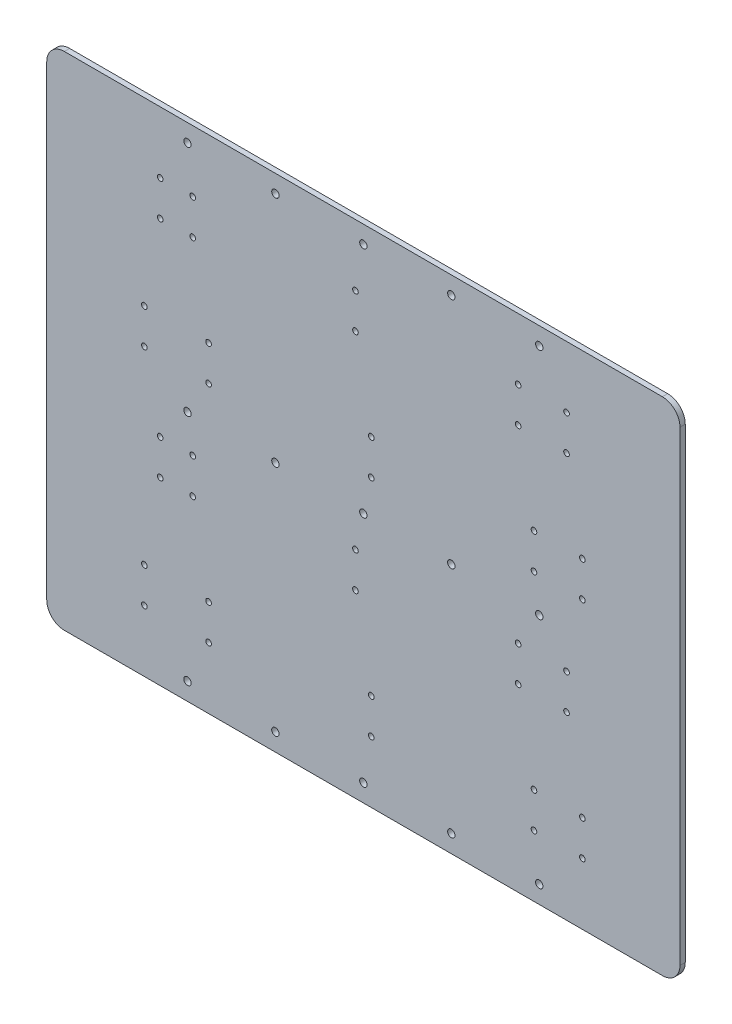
from build123d import *

# Parameters (mm, degrees)
SKETCH_1_W          = 360
SKETCH_1_H          = 275
EXTRUDE_1_DEPTH     = 3
SKETCH_3_R          = 1.6
CUT_EXTRUDE_1_DEPTH = 3
SKETCH_5_W          = 360
SKETCH_5_H          = 3
EXTRUDE_2_DEPTH     = 5
SKETCH_6_W          = 360
SKETCH_6_H          = 3
EXTRUDE_3_DEPTH     = 5
SKETCH_7_R          = 2.1
CUT_EXTRUDE_2_DEPTH = 10
FILLET_1_R          = 10


with BuildPart() as part:
    # Sketch 1 → Extrude 1 (new body)
    with BuildSketch(Plane.XY):
        with Locations((180, 137.5)):
            Rectangle(SKETCH_1_W, SKETCH_1_H)
    extrude(amount=EXTRUDE_1_DEPTH)

    # Sketch 3 → Cut-Extrude 1 (cut)
    with BuildSketch(Plane.XY.offset(3)):
        with Locations((175.5, 245)):
            Circle(SKETCH_3_R)
        with Locations((175.5, 225)):
            Circle(SKETCH_3_R)
        with Locations((184.5, 177.5)):
            Circle(SKETCH_3_R)
        with Locations((184.5, 157.5)):
            Circle(SKETCH_3_R)
        with Locations((184.5, 30)):
            Circle(SKETCH_3_R)
        with Locations((184.5, 50)):
            Circle(SKETCH_3_R)
        with Locations((175.5, 97.5)):
            Circle(SKETCH_3_R)
        with Locations((175.5, 117.5)):
            Circle(SKETCH_3_R)
        with Locations((295.5, 245)):
            Circle(SKETCH_3_R)
        with Locations((295.5, 225)):
            Circle(SKETCH_3_R)
        with Locations((304.5, 177.5)):
            Circle(SKETCH_3_R)
        with Locations((304.5, 157.5)):
            Circle(SKETCH_3_R)
        with Locations((304.5, 30)):
            Circle(SKETCH_3_R)
        with Locations((304.5, 50)):
            Circle(SKETCH_3_R)
        with Locations((295.5, 97.5)):
            Circle(SKETCH_3_R)
        with Locations((295.5, 117.5)):
            Circle(SKETCH_3_R)
        with Locations(Location((64.5, 117.5, 0), (0, 0, 180))):
            Circle(SKETCH_3_R)
        with Locations(Location((64.5, 97.5, 0), (0, 0, 180))):
            Circle(SKETCH_3_R)
        with Locations(Location((55.5, 50, 0), (0, 0, 180))):
            Circle(SKETCH_3_R)
        with Locations(Location((55.5, 30, 0), (0, 0, 180))):
            Circle(SKETCH_3_R)
        with Locations(Location((55.5, 157.5, 0), (0, 0, 180))):
            Circle(SKETCH_3_R)
        with Locations(Location((55.5, 177.5, 0), (0, 0, 180))):
            Circle(SKETCH_3_R)
        with Locations(Location((64.5, 225, 0), (0, 0, 180))):
            Circle(SKETCH_3_R)
        with Locations(Location((64.5, 245, 0), (0, 0, 180))):
            Circle(SKETCH_3_R)
        with Locations((268, 245)):
            Circle(SKETCH_3_R)
        with Locations((268, 225)):
            Circle(SKETCH_3_R)
        with Locations((277, 177.5)):
            Circle(SKETCH_3_R)
        with Locations((277, 157.5)):
            Circle(SKETCH_3_R)
        with Locations((277, 30)):
            Circle(SKETCH_3_R)
        with Locations((277, 50)):
            Circle(SKETCH_3_R)
        with Locations((268, 97.5)):
            Circle(SKETCH_3_R)
        with Locations((268, 117.5)):
            Circle(SKETCH_3_R)
        with Locations((83, 245)):
            Circle(SKETCH_3_R)
        with Locations((83, 225)):
            Circle(SKETCH_3_R)
        with Locations((92, 177.5)):
            Circle(SKETCH_3_R)
        with Locations((92, 157.5)):
            Circle(SKETCH_3_R)
        with Locations((92, 30)):
            Circle(SKETCH_3_R)
        with Locations((92, 50)):
            Circle(SKETCH_3_R)
        with Locations((83, 97.5)):
            Circle(SKETCH_3_R)
        with Locations((83, 117.5)):
            Circle(SKETCH_3_R)
    extrude(amount=-CUT_EXTRUDE_1_DEPTH, mode=Mode.SUBTRACT)

    # Sketch 5 → Extrude 2 (add)
    with BuildSketch(Plane(origin=(0, 275, 0), x_dir=(1, 0, 0), z_dir=(0, 1, 0))):
        with Locations((180, -1.5)):
            Rectangle(SKETCH_5_W, SKETCH_5_H)
    extrude(amount=EXTRUDE_2_DEPTH)

    # Sketch 6 → Extrude 3 (add)
    with BuildSketch(Plane.XZ):
        with Locations((180, 1.5)):
            Rectangle(SKETCH_6_W, SKETCH_6_H)
    extrude(amount=EXTRUDE_3_DEPTH)

    # Sketch 7 → Cut-Extrude 2 (cut)
    with BuildSketch(Plane.XY.offset(3)):
        with Locations((180, 5)):
            Circle(SKETCH_7_R)
        with Locations((130, 5)):
            Circle(SKETCH_7_R)
        with Locations((80, 5)):
            Circle(SKETCH_7_R)
        with Locations(Location((280, 5, 0), (0, 0, 180))):
            Circle(SKETCH_7_R)
        with Locations(Location((230, 5, 0), (0, 0, 180))):
            Circle(SKETCH_7_R)
        with Locations((230, 270)):
            Circle(SKETCH_7_R)
        with Locations((280, 270)):
            Circle(SKETCH_7_R)
        with Locations(Location((80, 270, 0), (0, 0, 180))):
            Circle(SKETCH_7_R)
        with Locations(Location((130, 270, 0), (0, 0, 180))):
            Circle(SKETCH_7_R)
        with Locations(Location((180, 270, 0), (0, 0, 180))):
            Circle(SKETCH_7_R)
        with Locations(Location((280, 137.5, 0), (0, 0, 180))):
            Circle(SKETCH_7_R)
        with Locations((80, 137.5)):
            Circle(SKETCH_7_R)
        with Locations(Location((230, 137.5, 0), (0, 0, 180))):
            Circle(SKETCH_7_R)
        with Locations((130, 137.5)):
            Circle(SKETCH_7_R)
        with Locations((180, 137.5)):
            Circle(SKETCH_7_R)
    extrude(amount=-CUT_EXTRUDE_2_DEPTH, mode=Mode.SUBTRACT)

    # Fillet 1
    fillet_1_edges = [part.edges().sort_by_distance(p)[0] for p in [
        (360, 280, 1.5),
        (0, 280, 1.5),
        (0, -5, 1.5),
        (360, -5, 1.5),
    ]]
    fillet(fillet_1_edges, radius=FILLET_1_R)


solid = part.part
